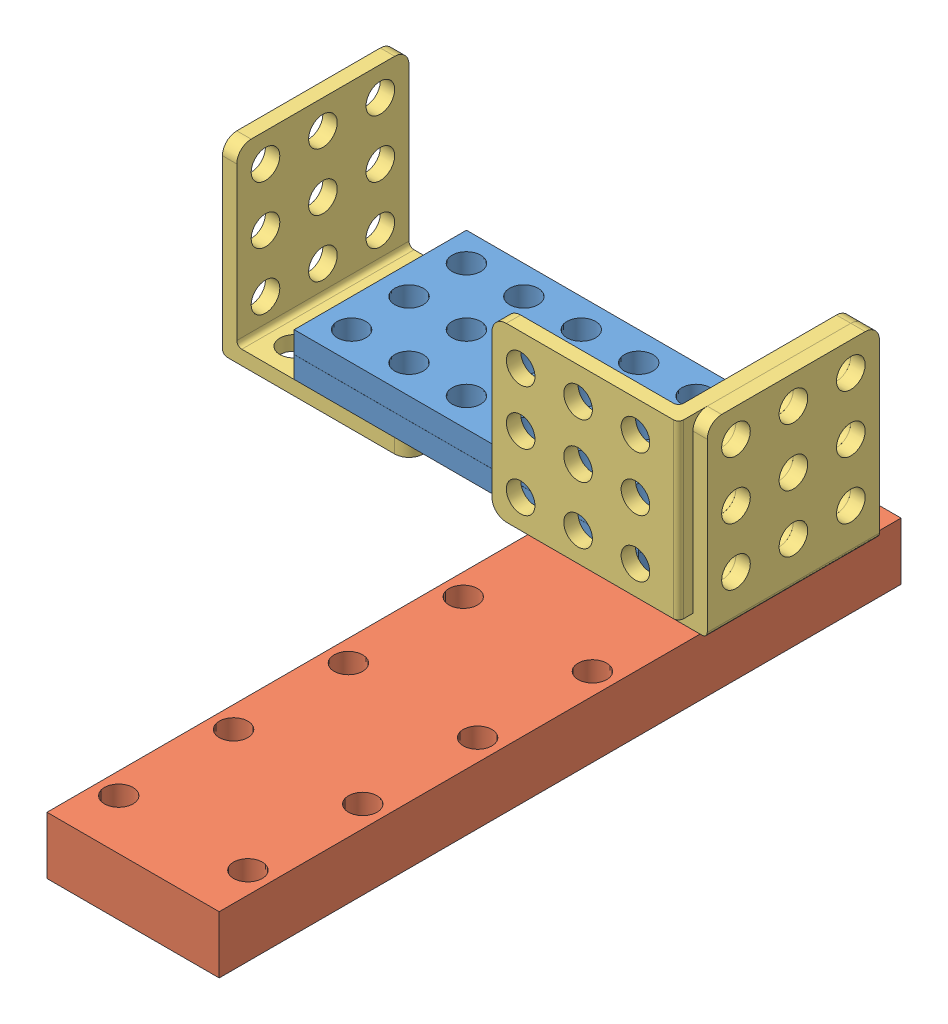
SolidWorks assembly 装甲后2.SLDASM, configuration 默认 (file format 10000). Lengths in mm.
Overall size (68 34 95).
6 component instances, 3 part files, 12 mates.
Components (placement in the parent):
- 6x3-1: 6x3.SLDPRT [默认] at (13.0241 -67.9685 128.474) size (48 3 24)
- 6孔-1: 6孔.SLDPRT [默认] at (37.4537 -69.9685 132.2781) x (0 0 1) z (1 0 0) size (95 8 24)
- 搞了半天的90度折角件-1: 搞了半天的90度折角件.SLDPRT [默认] at (-18.7093 -43.9685 117.5407) x (0 -1 0) z (0 0 1) size (26 26 24)
- 6x3-2: 6x3.SLDPRT [默认] at (13.0241 -64.957 128.474) size (48 3 24)
- 搞了半天的90度折角件-2: 搞了半天的90度折角件.SLDPRT [默认] at (47.2907 -43.9685 117.9874) x (0 0 1) z (0 -1 0) size (26 26 24)
- 搞了半天的90度折角件-3: 搞了半天的90度折角件.SLDPRT [默认] at (49.2907 -43.9685 141.9874) x (0 -1 0) z (0 0 -1) size (26 26 24)
Mates (geometry in assembly coordinates):
- 平行1: parallel aligned: line of 6x3-1 through (-8.7093 -64.9685 117.5407) axis (0 0 1); line of 搞了半天的90度折角件-1 through (7.2907 -67.9685 119.5407) axis (0 0 1)
- 同心2: concentric aligned: circle of 6x3-1; circle of 6x3-2
- 锁定2: lock: unknown of 6x3-1; unknown of 6x3-2
- 重合17: coincident aligned: circle of 6x3-1; circle of 搞了半天的90度折角件-1
- 同心6: concentric aligned: circle of 6x3-1; circle of 搞了半天的90度折角件-1
- 同心8: concentric aligned: circle of 搞了半天的90度折角件-2; circle of 搞了半天的90度折角件-3
- 同心9: concentric aligned: circle of 搞了半天的90度折角件-2; circle of 搞了半天的90度折角件-3
- 重合23: coincident anti-aligned: plane of 搞了半天的90度折角件-2 through (47.2907 -43.9685 117.9874) normal (1 0 0); plane of 搞了半天的90度折角件-3 through (47.2907 -43.9685 141.9874) normal (-1 0 0)
- 重合24: coincident aligned: circle of 6x3-1; circle of 搞了半天的90度折角件-3
- 平行4: parallel aligned: line of 6x3-1 through (39.2907 -67.9685 141.5407) axis (0 0 -1); line of 搞了半天的90度折角件-3 through (23.2907 -69.9685 139.9874) axis (0 0 -1)
- 重合25: coincident anti-aligned: circle of 6孔-1; circle of 搞了半天的90度折角件-3
- 平行5: parallel aligned: line of 6孔-1 through (24.2907 -77.9685 208.9874) axis (0 0 -1); line of 搞了半天的90度折角件-3 through (23.2907 -69.9685 139.9874) axis (0 0 -1)
